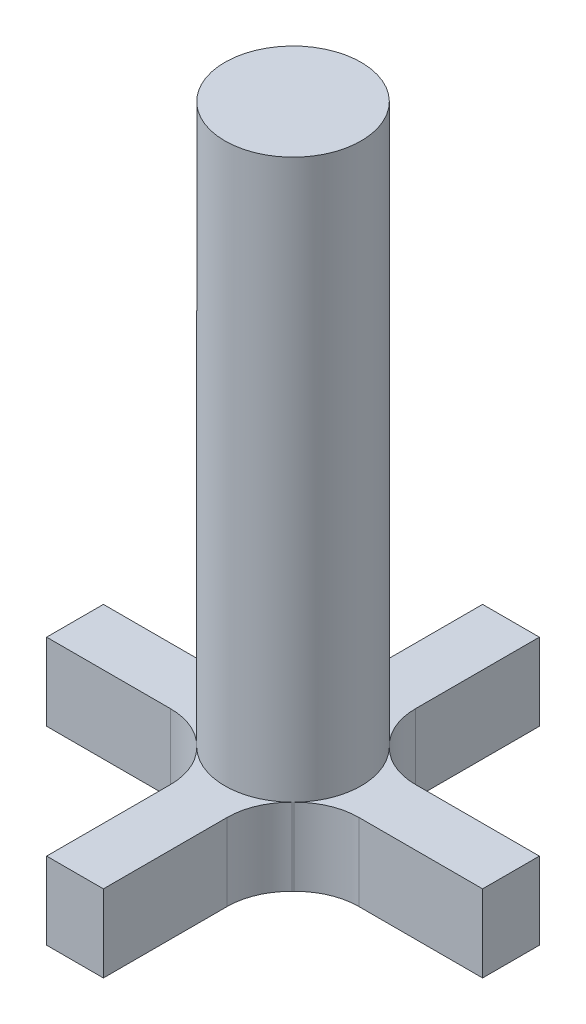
ISO-10303-21;
HEADER;
FILE_DESCRIPTION(('STEP AP214'),'2;1');
FILE_NAME('part.step','',(''),(''),'','','');
FILE_SCHEMA(('AUTOMOTIVE_DESIGN { 1 0 10303 214 1 1 1 1 }'));
ENDSEC;
DATA;
#1=APPLICATION_CONTEXT('core data for automotive mechanical design processes');
#2=APPLICATION_PROTOCOL_DEFINITION('international standard','automotive_design',2000,#1);
#3=PRODUCT_CONTEXT('',#1,'mechanical');
#4=PRODUCT('Part','Part','',(#3));
#5=PRODUCT_RELATED_PRODUCT_CATEGORY('part','',(#4));
#6=PRODUCT_DEFINITION_FORMATION('','',#4);
#7=PRODUCT_DEFINITION_CONTEXT('part definition',#1,'design');
#8=PRODUCT_DEFINITION('design','',#6,#7);
#9=PRODUCT_DEFINITION_SHAPE('','',#8);
#10=(LENGTH_UNIT() NAMED_UNIT(*) SI_UNIT(.MILLI.,.METRE.));
#11=(NAMED_UNIT(*) PLANE_ANGLE_UNIT() SI_UNIT($,.RADIAN.));
#12=(NAMED_UNIT(*) SI_UNIT($,.STERADIAN.) SOLID_ANGLE_UNIT());
#13=UNCERTAINTY_MEASURE_WITH_UNIT(LENGTH_MEASURE(1.E-05),#10,'distance_accuracy_value','');
#14=(GEOMETRIC_REPRESENTATION_CONTEXT(3) GLOBAL_UNCERTAINTY_ASSIGNED_CONTEXT((#13)) GLOBAL_UNIT_ASSIGNED_CONTEXT((#10,
#11,#12)) REPRESENTATION_CONTEXT('',''));
#15=CARTESIAN_POINT('',(0.,0.,0.));
#16=DIRECTION('',(0.,0.,1.));
#17=DIRECTION('',(1.,0.,0.));
#18=AXIS2_PLACEMENT_3D('',#15,#16,#17);
#19=CARTESIAN_POINT('',(0.,35.56,0.));
#20=DIRECTION('',(0.,-1.,0.));
#21=DIRECTION('',(0.,0.,-1.));
#22=AXIS2_PLACEMENT_3D('',#19,#20,#21);
#23=CYLINDRICAL_SURFACE('',#22,3.81);
#24=CARTESIAN_POINT('',(0.,35.56,0.));
#25=DIRECTION('',(0.,1.,0.));
#26=DIRECTION('',(0.,0.,1.));
#27=AXIS2_PLACEMENT_3D('',#24,#25,#26);
#28=CIRCLE('',#27,3.81);
#29=CARTESIAN_POINT('',(0.,35.56,3.81));
#30=VERTEX_POINT('',#29);
#31=EDGE_CURVE('E341',#30,#30,#28,.T.);
#32=ORIENTED_EDGE('',*,*,#31,.F.);
#33=EDGE_LOOP('',(#32));
#34=FACE_BOUND('',#33,.T.);
#35=CARTESIAN_POINT('',(0.,0.,0.));
#36=DIRECTION('',(0.,1.,0.));
#37=DIRECTION('',(0.,0.,1.));
#38=AXIS2_PLACEMENT_3D('',#35,#36,#37);
#39=CIRCLE('',#38,3.81);
#40=CARTESIAN_POINT('',(2.72730759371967,0.,-2.66043103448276));
#41=VERTEX_POINT('',#40);
#42=CARTESIAN_POINT('',(2.66043103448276,0.,-2.72730759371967));
#43=VERTEX_POINT('',#42);
#44=EDGE_CURVE('E347',#41,#43,#39,.T.);
#45=ORIENTED_EDGE('',*,*,#44,.T.);
#46=DIRECTION('',(0.,-1.,0.));
#47=VECTOR('',#46,1.);
#48=CARTESIAN_POINT('',(2.66043103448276,35.56,-2.72730759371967));
#49=LINE('',#48,#47);
#50=CARTESIAN_POINT('',(2.66043103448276,4.318,-2.72730759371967));
#51=VERTEX_POINT('',#50);
#52=EDGE_CURVE('E383',#43,#51,#49,.F.);
#53=ORIENTED_EDGE('',*,*,#52,.T.);
#54=CARTESIAN_POINT('',(0.,4.318,0.));
#55=DIRECTION('',(0.,-1.,0.));
#56=DIRECTION('',(0.,0.,-1.));
#57=AXIS2_PLACEMENT_3D('',#54,#55,#56);
#58=CIRCLE('',#57,3.81);
#59=CARTESIAN_POINT('',(-2.66043103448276,4.318,-2.72730759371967));
#60=VERTEX_POINT('',#59);
#61=EDGE_CURVE('E215',#60,#51,#58,.T.);
#62=ORIENTED_EDGE('',*,*,#61,.F.);
#63=DIRECTION('',(0.,-1.,0.));
#64=VECTOR('',#63,1.);
#65=CARTESIAN_POINT('',(-2.66043103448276,35.56,-2.72730759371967));
#66=LINE('',#65,#64);
#67=CARTESIAN_POINT('',(-2.66043103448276,0.,-2.72730759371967));
#68=VERTEX_POINT('',#67);
#69=EDGE_CURVE('E375',#60,#68,#66,.T.);
#70=ORIENTED_EDGE('',*,*,#69,.T.);
#71=CARTESIAN_POINT('',(-2.72730759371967,0.,-2.66043103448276));
#72=VERTEX_POINT('',#71);
#73=EDGE_CURVE('E351',#68,#72,#39,.T.);
#74=ORIENTED_EDGE('',*,*,#73,.T.);
#75=DIRECTION('',(0.,-1.,0.));
#76=VECTOR('',#75,1.);
#77=CARTESIAN_POINT('',(-2.72730759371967,35.56,-2.66043103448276));
#78=LINE('',#77,#76);
#79=CARTESIAN_POINT('',(-2.72730759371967,4.318,-2.66043103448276));
#80=VERTEX_POINT('',#79);
#81=EDGE_CURVE('E371',#72,#80,#78,.F.);
#82=ORIENTED_EDGE('',*,*,#81,.T.);
#83=CARTESIAN_POINT('',(0.,4.318,0.));
#84=DIRECTION('',(0.,-1.,0.));
#85=DIRECTION('',(0.,0.,-1.));
#86=AXIS2_PLACEMENT_3D('',#83,#84,#85);
#87=CIRCLE('',#86,3.81);
#88=CARTESIAN_POINT('',(-2.72730759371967,4.318,2.66043103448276));
#89=VERTEX_POINT('',#88);
#90=EDGE_CURVE('E254',#89,#80,#87,.T.);
#91=ORIENTED_EDGE('',*,*,#90,.F.);
#92=DIRECTION('',(0.,-1.,0.));
#93=VECTOR('',#92,1.);
#94=CARTESIAN_POINT('',(-2.72730759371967,35.56,2.66043103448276));
#95=LINE('',#94,#93);
#96=CARTESIAN_POINT('',(-2.72730759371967,0.,2.66043103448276));
#97=VERTEX_POINT('',#96);
#98=EDGE_CURVE('E367',#89,#97,#95,.T.);
#99=ORIENTED_EDGE('',*,*,#98,.T.);
#100=CARTESIAN_POINT('',(-2.66043103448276,0.,2.72730759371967));
#101=VERTEX_POINT('',#100);
#102=EDGE_CURVE('E337',#97,#101,#39,.T.);
#103=ORIENTED_EDGE('',*,*,#102,.T.);
#104=DIRECTION('',(0.,-1.,0.));
#105=VECTOR('',#104,1.);
#106=CARTESIAN_POINT('',(-2.66043103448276,35.56,2.72730759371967));
#107=LINE('',#106,#105);
#108=CARTESIAN_POINT('',(-2.66043103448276,4.318,2.72730759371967));
#109=VERTEX_POINT('',#108);
#110=EDGE_CURVE('E363',#101,#109,#107,.F.);
#111=ORIENTED_EDGE('',*,*,#110,.T.);
#112=CARTESIAN_POINT('',(0.,4.318,0.));
#113=DIRECTION('',(0.,-1.,0.));
#114=DIRECTION('',(0.,0.,-1.));
#115=AXIS2_PLACEMENT_3D('',#112,#113,#114);
#116=CIRCLE('',#115,3.81);
#117=CARTESIAN_POINT('',(2.66043103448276,4.318,2.72730759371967));
#118=VERTEX_POINT('',#117);
#119=EDGE_CURVE('E321',#118,#109,#116,.T.);
#120=ORIENTED_EDGE('',*,*,#119,.F.);
#121=DIRECTION('',(0.,-1.,0.));
#122=VECTOR('',#121,1.);
#123=CARTESIAN_POINT('',(2.66043103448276,35.56,2.72730759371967));
#124=LINE('',#123,#122);
#125=CARTESIAN_POINT('',(2.66043103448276,0.,2.72730759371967));
#126=VERTEX_POINT('',#125);
#127=EDGE_CURVE('E359',#118,#126,#124,.T.);
#128=ORIENTED_EDGE('',*,*,#127,.T.);
#129=CARTESIAN_POINT('',(2.72730759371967,0.,2.66043103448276));
#130=VERTEX_POINT('',#129);
#131=EDGE_CURVE('E346',#126,#130,#39,.T.);
#132=ORIENTED_EDGE('',*,*,#131,.T.);
#133=DIRECTION('',(0.,-1.,0.));
#134=VECTOR('',#133,1.);
#135=CARTESIAN_POINT('',(2.72730759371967,35.56,2.66043103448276));
#136=LINE('',#135,#134);
#137=CARTESIAN_POINT('',(2.72730759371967,4.318,2.66043103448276));
#138=VERTEX_POINT('',#137);
#139=EDGE_CURVE('E355',#130,#138,#136,.F.);
#140=ORIENTED_EDGE('',*,*,#139,.T.);
#141=CARTESIAN_POINT('',(0.,4.318,0.));
#142=DIRECTION('',(0.,-1.,0.));
#143=DIRECTION('',(0.,0.,-1.));
#144=AXIS2_PLACEMENT_3D('',#141,#142,#143);
#145=CIRCLE('',#144,3.81);
#146=CARTESIAN_POINT('',(2.72730759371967,4.318,-2.66043103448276));
#147=VERTEX_POINT('',#146);
#148=EDGE_CURVE('E286',#147,#138,#145,.T.);
#149=ORIENTED_EDGE('',*,*,#148,.F.);
#150=DIRECTION('',(0.,-1.,0.));
#151=VECTOR('',#150,1.);
#152=CARTESIAN_POINT('',(2.72730759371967,35.56,-2.66043103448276));
#153=LINE('',#152,#151);
#154=EDGE_CURVE('E379',#147,#41,#153,.T.);
#155=ORIENTED_EDGE('',*,*,#154,.T.);
#156=EDGE_LOOP('',(#45,#53,#62,#70,#74,#82,#91,#99,#103,#111,#120,#128,#132,#140,#149,#155));
#157=FACE_BOUND('',#156,.T.);
#158=ADVANCED_FACE('F41',(#34,#157),#23,.T.);
#159=CARTESIAN_POINT('',(0.,35.56,0.));
#160=DIRECTION('',(0.,1.,0.));
#161=DIRECTION('',(0.,0.,1.));
#162=AXIS2_PLACEMENT_3D('',#159,#160,#161);
#163=PLANE('',#162);
#164=ORIENTED_EDGE('',*,*,#31,.T.);
#165=EDGE_LOOP('',(#164));
#166=FACE_BOUND('',#165,.T.);
#167=ADVANCED_FACE('F533',(#166),#163,.T.);
#168=CARTESIAN_POINT('',(0.,0.,0.));
#169=DIRECTION('',(0.,1.,0.));
#170=DIRECTION('',(0.,0.,1.));
#171=AXIS2_PLACEMENT_3D('',#168,#169,#170);
#172=PLANE('',#171);
#173=ORIENTED_EDGE('',*,*,#131,.F.);
#174=CARTESIAN_POINT('',(5.1435,0.,5.27279468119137));
#175=DIRECTION('',(0.,1.,0.));
#176=DIRECTION('',(0.,0.,1.));
#177=AXIS2_PLACEMENT_3D('',#174,#175,#176);
#178=CIRCLE('',#177,3.556);
#179=CARTESIAN_POINT('',(1.5875,0.,5.27279468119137));
#180=VERTEX_POINT('',#179);
#181=EDGE_CURVE('E447',#126,#180,#178,.T.);
#182=ORIENTED_EDGE('',*,*,#181,.T.);
#183=DIRECTION('',(0.,0.,-1.));
#184=VECTOR('',#183,1.);
#185=CARTESIAN_POINT('',(1.5875,0.,0.));
#186=LINE('',#185,#184);
#187=CARTESIAN_POINT('',(1.5875,0.,12.192));
#188=VERTEX_POINT('',#187);
#189=EDGE_CURVE('E305',#188,#180,#186,.T.);
#190=ORIENTED_EDGE('',*,*,#189,.F.);
#191=DIRECTION('',(1.,0.,0.));
#192=VECTOR('',#191,1.);
#193=CARTESIAN_POINT('',(0.,0.,12.192));
#194=LINE('',#193,#192);
#195=CARTESIAN_POINT('',(-1.5875,0.,12.192));
#196=VERTEX_POINT('',#195);
#197=EDGE_CURVE('E328',#196,#188,#194,.T.);
#198=ORIENTED_EDGE('',*,*,#197,.F.);
#199=DIRECTION('',(0.,0.,-1.));
#200=VECTOR('',#199,1.);
#201=CARTESIAN_POINT('',(-1.5875,0.,0.));
#202=LINE('',#201,#200);
#203=CARTESIAN_POINT('',(-1.5875,0.,5.27279468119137));
#204=VERTEX_POINT('',#203);
#205=EDGE_CURVE('E314',#196,#204,#202,.T.);
#206=ORIENTED_EDGE('',*,*,#205,.T.);
#207=CARTESIAN_POINT('',(-5.1435,0.,5.27279468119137));
#208=DIRECTION('',(0.,1.,0.));
#209=DIRECTION('',(0.,0.,1.));
#210=AXIS2_PLACEMENT_3D('',#207,#208,#209);
#211=CIRCLE('',#210,3.556);
#212=EDGE_CURVE('E441',#204,#101,#211,.T.);
#213=ORIENTED_EDGE('',*,*,#212,.T.);
#214=ORIENTED_EDGE('',*,*,#102,.F.);
#215=CARTESIAN_POINT('',(-5.27279468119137,0.,5.1435));
#216=DIRECTION('',(0.,1.,0.));
#217=DIRECTION('',(0.,0.,1.));
#218=AXIS2_PLACEMENT_3D('',#215,#216,#217);
#219=CIRCLE('',#218,3.556);
#220=CARTESIAN_POINT('',(-5.27279468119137,0.,1.5875));
#221=VERTEX_POINT('',#220);
#222=EDGE_CURVE('E434',#97,#221,#219,.T.);
#223=ORIENTED_EDGE('',*,*,#222,.T.);
#224=DIRECTION('',(1.,0.,0.));
#225=VECTOR('',#224,1.);
#226=CARTESIAN_POINT('',(0.,0.,1.5875));
#227=LINE('',#226,#225);
#228=CARTESIAN_POINT('',(-12.192,0.,1.5875));
#229=VERTEX_POINT('',#228);
#230=EDGE_CURVE('E250',#229,#221,#227,.T.);
#231=ORIENTED_EDGE('',*,*,#230,.F.);
#232=DIRECTION('',(0.,0.,-1.));
#233=VECTOR('',#232,1.);
#234=CARTESIAN_POINT('',(-12.192,0.,0.));
#235=LINE('',#234,#233);
#236=CARTESIAN_POINT('',(-12.192,0.,-1.5875));
#237=VERTEX_POINT('',#236);
#238=EDGE_CURVE('E243',#229,#237,#235,.T.);
#239=ORIENTED_EDGE('',*,*,#238,.T.);
#240=DIRECTION('',(1.,0.,0.));
#241=VECTOR('',#240,1.);
#242=CARTESIAN_POINT('',(0.,0.,-1.5875));
#243=LINE('',#242,#241);
#244=CARTESIAN_POINT('',(-5.27279468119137,0.,-1.5875));
#245=VERTEX_POINT('',#244);
#246=EDGE_CURVE('E265',#237,#245,#243,.T.);
#247=ORIENTED_EDGE('',*,*,#246,.T.);
#248=CARTESIAN_POINT('',(-5.27279468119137,0.,-5.1435));
#249=DIRECTION('',(0.,1.,0.));
#250=DIRECTION('',(0.,0.,1.));
#251=AXIS2_PLACEMENT_3D('',#248,#249,#250);
#252=CIRCLE('',#251,3.556);
#253=EDGE_CURVE('E428',#245,#72,#252,.T.);
#254=ORIENTED_EDGE('',*,*,#253,.T.);
#255=ORIENTED_EDGE('',*,*,#73,.F.);
#256=CARTESIAN_POINT('',(-5.1435,0.,-5.27279468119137));
#257=DIRECTION('',(0.,1.,0.));
#258=DIRECTION('',(0.,0.,1.));
#259=AXIS2_PLACEMENT_3D('',#256,#257,#258);
#260=CIRCLE('',#259,3.556);
#261=CARTESIAN_POINT('',(-1.5875,0.,-5.27279468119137));
#262=VERTEX_POINT('',#261);
#263=EDGE_CURVE('E422',#68,#262,#260,.T.);
#264=ORIENTED_EDGE('',*,*,#263,.T.);
#265=DIRECTION('',(0.,0.,-1.));
#266=VECTOR('',#265,1.);
#267=CARTESIAN_POINT('',(-1.5875,0.,0.));
#268=LINE('',#267,#266);
#269=CARTESIAN_POINT('',(-1.5875,0.,-12.192));
#270=VERTEX_POINT('',#269);
#271=EDGE_CURVE('E237',#262,#270,#268,.T.);
#272=ORIENTED_EDGE('',*,*,#271,.T.);
#273=DIRECTION('',(1.,0.,0.));
#274=VECTOR('',#273,1.);
#275=CARTESIAN_POINT('',(0.,0.,-12.192));
#276=LINE('',#275,#274);
#277=CARTESIAN_POINT('',(1.5875,0.,-12.192));
#278=VERTEX_POINT('',#277);
#279=EDGE_CURVE('E222',#270,#278,#276,.T.);
#280=ORIENTED_EDGE('',*,*,#279,.T.);
#281=DIRECTION('',(0.,0.,-1.));
#282=VECTOR('',#281,1.);
#283=CARTESIAN_POINT('',(1.5875,0.,0.));
#284=LINE('',#283,#282);
#285=CARTESIAN_POINT('',(1.5875,0.,-5.27279468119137));
#286=VERTEX_POINT('',#285);
#287=EDGE_CURVE('E234',#286,#278,#284,.T.);
#288=ORIENTED_EDGE('',*,*,#287,.F.);
#289=CARTESIAN_POINT('',(5.1435,0.,-5.27279468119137));
#290=DIRECTION('',(0.,1.,0.));
#291=DIRECTION('',(0.,0.,1.));
#292=AXIS2_PLACEMENT_3D('',#289,#290,#291);
#293=CIRCLE('',#292,3.556);
#294=EDGE_CURVE('E409',#286,#43,#293,.T.);
#295=ORIENTED_EDGE('',*,*,#294,.T.);
#296=ORIENTED_EDGE('',*,*,#44,.F.);
#297=CARTESIAN_POINT('',(5.27279468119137,0.,-5.1435));
#298=DIRECTION('',(0.,1.,0.));
#299=DIRECTION('',(0.,0.,1.));
#300=AXIS2_PLACEMENT_3D('',#297,#298,#299);
#301=CIRCLE('',#300,3.556);
#302=CARTESIAN_POINT('',(5.27279468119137,0.,-1.5875));
#303=VERTEX_POINT('',#302);
#304=EDGE_CURVE('E415',#41,#303,#301,.T.);
#305=ORIENTED_EDGE('',*,*,#304,.T.);
#306=DIRECTION('',(1.,0.,0.));
#307=VECTOR('',#306,1.);
#308=CARTESIAN_POINT('',(0.,0.,-1.5875));
#309=LINE('',#308,#307);
#310=CARTESIAN_POINT('',(12.192,0.,-1.5875));
#311=VERTEX_POINT('',#310);
#312=EDGE_CURVE('E283',#303,#311,#309,.T.);
#313=ORIENTED_EDGE('',*,*,#312,.T.);
#314=DIRECTION('',(0.,0.,-1.));
#315=VECTOR('',#314,1.);
#316=CARTESIAN_POINT('',(12.192,0.,0.));
#317=LINE('',#316,#315);
#318=CARTESIAN_POINT('',(12.192,0.,1.5875));
#319=VERTEX_POINT('',#318);
#320=EDGE_CURVE('E275',#319,#311,#317,.T.);
#321=ORIENTED_EDGE('',*,*,#320,.F.);
#322=DIRECTION('',(1.,0.,0.));
#323=VECTOR('',#322,1.);
#324=CARTESIAN_POINT('',(0.,0.,1.5875));
#325=LINE('',#324,#323);
#326=CARTESIAN_POINT('',(5.27279468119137,0.,1.5875));
#327=VERTEX_POINT('',#326);
#328=EDGE_CURVE('E296',#327,#319,#325,.T.);
#329=ORIENTED_EDGE('',*,*,#328,.F.);
#330=CARTESIAN_POINT('',(5.27279468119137,0.,5.1435));
#331=DIRECTION('',(0.,1.,0.));
#332=DIRECTION('',(0.,0.,1.));
#333=AXIS2_PLACEMENT_3D('',#330,#331,#332);
#334=CIRCLE('',#333,3.556);
#335=EDGE_CURVE('E50',#327,#130,#334,.T.);
#336=ORIENTED_EDGE('',*,*,#335,.T.);
#337=EDGE_LOOP('',(#173,#182,#190,#198,#206,#213,#214,#223,#231,#239,#247,#254,#255,#264,#272,
#280,#288,#295,#296,#305,#313,#321,#329,#336));
#338=FACE_BOUND('',#337,.T.);
#339=ADVANCED_FACE('F458',(#338),#172,.F.);
#340=CARTESIAN_POINT('',(1.5875,4.318,0.));
#341=DIRECTION('',(-1.,0.,0.));
#342=DIRECTION('',(0.,0.,1.));
#343=AXIS2_PLACEMENT_3D('',#340,#341,#342);
#344=PLANE('',#343);
#345=ORIENTED_EDGE('',*,*,#189,.T.);
#346=DIRECTION('',(0.,1.,0.));
#347=VECTOR('',#346,1.);
#348=CARTESIAN_POINT('',(1.5875,4.318,5.27279468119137));
#349=LINE('',#348,#347);
#350=CARTESIAN_POINT('',(1.5875,4.318,5.27279468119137));
#351=VERTEX_POINT('',#350);
#352=EDGE_CURVE('E403',#180,#351,#349,.T.);
#353=ORIENTED_EDGE('',*,*,#352,.T.);
#354=DIRECTION('',(0.,0.,-1.));
#355=VECTOR('',#354,1.);
#356=CARTESIAN_POINT('',(1.5875,4.318,0.));
#357=LINE('',#356,#355);
#358=CARTESIAN_POINT('',(1.5875,4.318,12.192));
#359=VERTEX_POINT('',#358);
#360=EDGE_CURVE('E309',#359,#351,#357,.T.);
#361=ORIENTED_EDGE('',*,*,#360,.F.);
#362=DIRECTION('',(0.,-1.,0.));
#363=VECTOR('',#362,1.);
#364=CARTESIAN_POINT('',(1.5875,4.318,12.192));
#365=LINE('',#364,#363);
#366=EDGE_CURVE('E324',#359,#188,#365,.T.);
#367=ORIENTED_EDGE('',*,*,#366,.T.);
#368=EDGE_LOOP('',(#345,#353,#361,#367));
#369=FACE_BOUND('',#368,.T.);
#370=ADVANCED_FACE('F525',(#369),#344,.F.);
#371=CARTESIAN_POINT('',(-1.5875,4.318,0.));
#372=DIRECTION('',(-1.,0.,0.));
#373=DIRECTION('',(0.,0.,1.));
#374=AXIS2_PLACEMENT_3D('',#371,#372,#373);
#375=PLANE('',#374);
#376=DIRECTION('',(0.,0.,-1.));
#377=VECTOR('',#376,1.);
#378=CARTESIAN_POINT('',(-1.5875,4.318,0.));
#379=LINE('',#378,#377);
#380=CARTESIAN_POINT('',(-1.5875,4.318,12.192));
#381=VERTEX_POINT('',#380);
#382=CARTESIAN_POINT('',(-1.5875,4.318,5.27279468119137));
#383=VERTEX_POINT('',#382);
#384=EDGE_CURVE('E317',#381,#383,#379,.T.);
#385=ORIENTED_EDGE('',*,*,#384,.T.);
#386=DIRECTION('',(0.,-1.,0.));
#387=VECTOR('',#386,1.);
#388=CARTESIAN_POINT('',(-1.5875,4.318,5.27279468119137));
#389=LINE('',#388,#387);
#390=EDGE_CURVE('E399',#383,#204,#389,.T.);
#391=ORIENTED_EDGE('',*,*,#390,.T.);
#392=ORIENTED_EDGE('',*,*,#205,.F.);
#393=DIRECTION('',(0.,-1.,0.));
#394=VECTOR('',#393,1.);
#395=CARTESIAN_POINT('',(-1.5875,4.318,12.192));
#396=LINE('',#395,#394);
#397=EDGE_CURVE('E334',#381,#196,#396,.T.);
#398=ORIENTED_EDGE('',*,*,#397,.F.);
#399=EDGE_LOOP('',(#385,#391,#392,#398));
#400=FACE_BOUND('',#399,.T.);
#401=ADVANCED_FACE('F511',(#400),#375,.T.);
#402=CARTESIAN_POINT('',(0.,4.318,12.192));
#403=DIRECTION('',(0.,0.,-1.));
#404=DIRECTION('',(-1.,0.,0.));
#405=AXIS2_PLACEMENT_3D('',#402,#403,#404);
#406=PLANE('',#405);
#407=ORIENTED_EDGE('',*,*,#197,.T.);
#408=ORIENTED_EDGE('',*,*,#366,.F.);
#409=DIRECTION('',(1.,0.,0.));
#410=VECTOR('',#409,1.);
#411=CARTESIAN_POINT('',(0.,4.318,12.192));
#412=LINE('',#411,#410);
#413=EDGE_CURVE('E313',#381,#359,#412,.T.);
#414=ORIENTED_EDGE('',*,*,#413,.F.);
#415=ORIENTED_EDGE('',*,*,#397,.T.);
#416=EDGE_LOOP('',(#407,#408,#414,#415));
#417=FACE_BOUND('',#416,.T.);
#418=ADVANCED_FACE('F517',(#417),#406,.F.);
#419=CARTESIAN_POINT('',(0.,4.318,0.));
#420=DIRECTION('',(0.,-1.,0.));
#421=DIRECTION('',(0.,0.,-1.));
#422=AXIS2_PLACEMENT_3D('',#419,#420,#421);
#423=PLANE('',#422);
#424=ORIENTED_EDGE('',*,*,#360,.T.);
#425=CARTESIAN_POINT('',(5.1435,4.318,5.27279468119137));
#426=DIRECTION('',(0.,-1.,0.));
#427=DIRECTION('',(0.,0.,-1.));
#428=AXIS2_PLACEMENT_3D('',#425,#426,#427);
#429=CIRCLE('',#428,3.556);
#430=EDGE_CURVE('E450',#351,#118,#429,.T.);
#431=ORIENTED_EDGE('',*,*,#430,.T.);
#432=ORIENTED_EDGE('',*,*,#119,.T.);
#433=CARTESIAN_POINT('',(-5.1435,4.318,5.27279468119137));
#434=DIRECTION('',(0.,-1.,0.));
#435=DIRECTION('',(0.,0.,-1.));
#436=AXIS2_PLACEMENT_3D('',#433,#434,#435);
#437=CIRCLE('',#436,3.556);
#438=EDGE_CURVE('E444',#109,#383,#437,.T.);
#439=ORIENTED_EDGE('',*,*,#438,.T.);
#440=ORIENTED_EDGE('',*,*,#384,.F.);
#441=ORIENTED_EDGE('',*,*,#413,.T.);
#442=EDGE_LOOP('',(#424,#431,#432,#439,#440,#441));
#443=FACE_BOUND('',#442,.T.);
#444=ADVANCED_FACE('F509',(#443),#423,.F.);
#445=CARTESIAN_POINT('',(12.192,4.318,0.));
#446=DIRECTION('',(-1.,0.,0.));
#447=DIRECTION('',(0.,0.,1.));
#448=AXIS2_PLACEMENT_3D('',#445,#446,#447);
#449=PLANE('',#448);
#450=ORIENTED_EDGE('',*,*,#320,.T.);
#451=DIRECTION('',(0.,-1.,0.));
#452=VECTOR('',#451,1.);
#453=CARTESIAN_POINT('',(12.192,4.318,-1.5875));
#454=LINE('',#453,#452);
#455=CARTESIAN_POINT('',(12.192,4.318,-1.5875));
#456=VERTEX_POINT('',#455);
#457=EDGE_CURVE('E301',#456,#311,#454,.T.);
#458=ORIENTED_EDGE('',*,*,#457,.F.);
#459=DIRECTION('',(0.,0.,-1.));
#460=VECTOR('',#459,1.);
#461=CARTESIAN_POINT('',(12.192,4.318,0.));
#462=LINE('',#461,#460);
#463=CARTESIAN_POINT('',(12.192,4.318,1.5875));
#464=VERTEX_POINT('',#463);
#465=EDGE_CURVE('E278',#464,#456,#462,.T.);
#466=ORIENTED_EDGE('',*,*,#465,.F.);
#467=DIRECTION('',(0.,-1.,0.));
#468=VECTOR('',#467,1.);
#469=CARTESIAN_POINT('',(12.192,4.318,1.5875));
#470=LINE('',#469,#468);
#471=EDGE_CURVE('E292',#464,#319,#470,.T.);
#472=ORIENTED_EDGE('',*,*,#471,.T.);
#473=EDGE_LOOP('',(#450,#458,#466,#472));
#474=FACE_BOUND('',#473,.T.);
#475=ADVANCED_FACE('F472',(#474),#449,.F.);
#476=CARTESIAN_POINT('',(0.,4.318,-1.5875));
#477=DIRECTION('',(0.,0.,-1.));
#478=DIRECTION('',(-1.,0.,0.));
#479=AXIS2_PLACEMENT_3D('',#476,#477,#478);
#480=PLANE('',#479);
#481=ORIENTED_EDGE('',*,*,#312,.F.);
#482=DIRECTION('',(0.,-1.,0.));
#483=VECTOR('',#482,1.);
#484=CARTESIAN_POINT('',(5.27279468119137,4.318,-1.5875));
#485=LINE('',#484,#483);
#486=CARTESIAN_POINT('',(5.27279468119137,4.318,-1.5875));
#487=VERTEX_POINT('',#486);
#488=EDGE_CURVE('E387',#303,#487,#485,.F.);
#489=ORIENTED_EDGE('',*,*,#488,.T.);
#490=DIRECTION('',(1.,0.,0.));
#491=VECTOR('',#490,1.);
#492=CARTESIAN_POINT('',(0.,4.318,-1.5875));
#493=LINE('',#492,#491);
#494=EDGE_CURVE('E289',#487,#456,#493,.T.);
#495=ORIENTED_EDGE('',*,*,#494,.T.);
#496=ORIENTED_EDGE('',*,*,#457,.T.);
#497=EDGE_LOOP('',(#481,#489,#495,#496));
#498=FACE_BOUND('',#497,.T.);
#499=ADVANCED_FACE('F475',(#498),#480,.T.);
#500=CARTESIAN_POINT('',(0.,4.318,1.5875));
#501=DIRECTION('',(0.,0.,-1.));
#502=DIRECTION('',(-1.,0.,0.));
#503=AXIS2_PLACEMENT_3D('',#500,#501,#502);
#504=PLANE('',#503);
#505=DIRECTION('',(1.,0.,0.));
#506=VECTOR('',#505,1.);
#507=CARTESIAN_POINT('',(0.,4.318,1.5875));
#508=LINE('',#507,#506);
#509=CARTESIAN_POINT('',(5.27279468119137,4.318,1.5875));
#510=VERTEX_POINT('',#509);
#511=EDGE_CURVE('E282',#510,#464,#508,.T.);
#512=ORIENTED_EDGE('',*,*,#511,.F.);
#513=DIRECTION('',(0.,1.,0.));
#514=VECTOR('',#513,1.);
#515=CARTESIAN_POINT('',(5.27279468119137,0.,1.5875));
#516=LINE('',#515,#514);
#517=EDGE_CURVE('E406',#510,#327,#516,.F.);
#518=ORIENTED_EDGE('',*,*,#517,.T.);
#519=ORIENTED_EDGE('',*,*,#328,.T.);
#520=ORIENTED_EDGE('',*,*,#471,.F.);
#521=EDGE_LOOP('',(#512,#518,#519,#520));
#522=FACE_BOUND('',#521,.T.);
#523=ADVANCED_FACE('F464',(#522),#504,.F.);
#524=CARTESIAN_POINT('',(0.,4.318,0.));
#525=DIRECTION('',(0.,-1.,0.));
#526=DIRECTION('',(0.,0.,-1.));
#527=AXIS2_PLACEMENT_3D('',#524,#525,#526);
#528=PLANE('',#527);
#529=ORIENTED_EDGE('',*,*,#465,.T.);
#530=ORIENTED_EDGE('',*,*,#494,.F.);
#531=CARTESIAN_POINT('',(5.27279468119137,4.318,-5.1435));
#532=DIRECTION('',(0.,-1.,0.));
#533=DIRECTION('',(0.,0.,-1.));
#534=AXIS2_PLACEMENT_3D('',#531,#532,#533);
#535=CIRCLE('',#534,3.556);
#536=EDGE_CURVE('E418',#487,#147,#535,.T.);
#537=ORIENTED_EDGE('',*,*,#536,.T.);
#538=ORIENTED_EDGE('',*,*,#148,.T.);
#539=CARTESIAN_POINT('',(5.27279468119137,4.318,5.1435));
#540=DIRECTION('',(0.,-1.,0.));
#541=DIRECTION('',(0.,0.,-1.));
#542=AXIS2_PLACEMENT_3D('',#539,#540,#541);
#543=CIRCLE('',#542,3.556);
#544=EDGE_CURVE('E11',#138,#510,#543,.T.);
#545=ORIENTED_EDGE('',*,*,#544,.T.);
#546=ORIENTED_EDGE('',*,*,#511,.T.);
#547=EDGE_LOOP('',(#529,#530,#537,#538,#545,#546));
#548=FACE_BOUND('',#547,.T.);
#549=ADVANCED_FACE('F467',(#548),#528,.F.);
#550=CARTESIAN_POINT('',(-12.192,4.318,0.));
#551=DIRECTION('',(-1.,0.,0.));
#552=DIRECTION('',(0.,0.,1.));
#553=AXIS2_PLACEMENT_3D('',#550,#551,#552);
#554=PLANE('',#553);
#555=ORIENTED_EDGE('',*,*,#238,.F.);
#556=DIRECTION('',(0.,-1.,0.));
#557=VECTOR('',#556,1.);
#558=CARTESIAN_POINT('',(-12.192,4.318,1.5875));
#559=LINE('',#558,#557);
#560=CARTESIAN_POINT('',(-12.192,4.318,1.5875));
#561=VERTEX_POINT('',#560);
#562=EDGE_CURVE('E272',#561,#229,#559,.T.);
#563=ORIENTED_EDGE('',*,*,#562,.F.);
#564=DIRECTION('',(0.,0.,-1.));
#565=VECTOR('',#564,1.);
#566=CARTESIAN_POINT('',(-12.192,4.318,0.));
#567=LINE('',#566,#565);
#568=CARTESIAN_POINT('',(-12.192,4.318,-1.5875));
#569=VERTEX_POINT('',#568);
#570=EDGE_CURVE('E245',#561,#569,#567,.T.);
#571=ORIENTED_EDGE('',*,*,#570,.T.);
#572=DIRECTION('',(0.,-1.,0.));
#573=VECTOR('',#572,1.);
#574=CARTESIAN_POINT('',(-12.192,4.318,-1.5875));
#575=LINE('',#574,#573);
#576=EDGE_CURVE('E261',#569,#237,#575,.T.);
#577=ORIENTED_EDGE('',*,*,#576,.T.);
#578=EDGE_LOOP('',(#555,#563,#571,#577));
#579=FACE_BOUND('',#578,.T.);
#580=ADVANCED_FACE('F664',(#579),#554,.T.);
#581=CARTESIAN_POINT('',(0.,4.318,1.5875));
#582=DIRECTION('',(0.,0.,-1.));
#583=DIRECTION('',(-1.,0.,0.));
#584=AXIS2_PLACEMENT_3D('',#581,#582,#583);
#585=PLANE('',#584);
#586=ORIENTED_EDGE('',*,*,#230,.T.);
#587=DIRECTION('',(0.,1.,0.));
#588=VECTOR('',#587,1.);
#589=CARTESIAN_POINT('',(-5.27279468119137,4.318,1.5875));
#590=LINE('',#589,#588);
#591=CARTESIAN_POINT('',(-5.27279468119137,4.318,1.5875));
#592=VERTEX_POINT('',#591);
#593=EDGE_CURVE('E396',#221,#592,#590,.T.);
#594=ORIENTED_EDGE('',*,*,#593,.T.);
#595=DIRECTION('',(1.,0.,0.));
#596=VECTOR('',#595,1.);
#597=CARTESIAN_POINT('',(0.,4.318,1.5875));
#598=LINE('',#597,#596);
#599=EDGE_CURVE('E257',#561,#592,#598,.T.);
#600=ORIENTED_EDGE('',*,*,#599,.F.);
#601=ORIENTED_EDGE('',*,*,#562,.T.);
#602=EDGE_LOOP('',(#586,#594,#600,#601));
#603=FACE_BOUND('',#602,.T.);
#604=ADVANCED_FACE('F654',(#603),#585,.F.);
#605=CARTESIAN_POINT('',(0.,4.318,-1.5875));
#606=DIRECTION('',(0.,0.,-1.));
#607=DIRECTION('',(-1.,0.,0.));
#608=AXIS2_PLACEMENT_3D('',#605,#606,#607);
#609=PLANE('',#608);
#610=DIRECTION('',(1.,0.,0.));
#611=VECTOR('',#610,1.);
#612=CARTESIAN_POINT('',(0.,4.318,-1.5875));
#613=LINE('',#612,#611);
#614=CARTESIAN_POINT('',(-5.27279468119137,4.318,-1.5875));
#615=VERTEX_POINT('',#614);
#616=EDGE_CURVE('E249',#569,#615,#613,.T.);
#617=ORIENTED_EDGE('',*,*,#616,.T.);
#618=DIRECTION('',(0.,-1.,0.));
#619=VECTOR('',#618,1.);
#620=CARTESIAN_POINT('',(-5.27279468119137,4.318,-1.5875));
#621=LINE('',#620,#619);
#622=EDGE_CURVE('E392',#615,#245,#621,.T.);
#623=ORIENTED_EDGE('',*,*,#622,.T.);
#624=ORIENTED_EDGE('',*,*,#246,.F.);
#625=ORIENTED_EDGE('',*,*,#576,.F.);
#626=EDGE_LOOP('',(#617,#623,#624,#625));
#627=FACE_BOUND('',#626,.T.);
#628=ADVANCED_FACE('F644',(#627),#609,.T.);
#629=CARTESIAN_POINT('',(0.,4.318,0.));
#630=DIRECTION('',(0.,-1.,0.));
#631=DIRECTION('',(0.,0.,-1.));
#632=AXIS2_PLACEMENT_3D('',#629,#630,#631);
#633=PLANE('',#632);
#634=ORIENTED_EDGE('',*,*,#570,.F.);
#635=ORIENTED_EDGE('',*,*,#599,.T.);
#636=CARTESIAN_POINT('',(-5.27279468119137,4.318,5.1435));
#637=DIRECTION('',(0.,-1.,0.));
#638=DIRECTION('',(0.,0.,-1.));
#639=AXIS2_PLACEMENT_3D('',#636,#637,#638);
#640=CIRCLE('',#639,3.556);
#641=EDGE_CURVE('E437',#592,#89,#640,.T.);
#642=ORIENTED_EDGE('',*,*,#641,.T.);
#643=ORIENTED_EDGE('',*,*,#90,.T.);
#644=CARTESIAN_POINT('',(-5.27279468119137,4.318,-5.1435));
#645=DIRECTION('',(0.,-1.,0.));
#646=DIRECTION('',(0.,0.,-1.));
#647=AXIS2_PLACEMENT_3D('',#644,#645,#646);
#648=CIRCLE('',#647,3.556);
#649=EDGE_CURVE('E431',#80,#615,#648,.T.);
#650=ORIENTED_EDGE('',*,*,#649,.T.);
#651=ORIENTED_EDGE('',*,*,#616,.F.);
#652=EDGE_LOOP('',(#634,#635,#642,#643,#650,#651));
#653=FACE_BOUND('',#652,.T.);
#654=ADVANCED_FACE('F635',(#653),#633,.F.);
#655=CARTESIAN_POINT('',(1.5875,4.318,0.));
#656=DIRECTION('',(-1.,0.,0.));
#657=DIRECTION('',(0.,0.,1.));
#658=AXIS2_PLACEMENT_3D('',#655,#656,#657);
#659=PLANE('',#658);
#660=DIRECTION('',(0.,0.,-1.));
#661=VECTOR('',#660,1.);
#662=CARTESIAN_POINT('',(1.5875,4.318,0.));
#663=LINE('',#662,#661);
#664=CARTESIAN_POINT('',(1.5875,4.318,-5.27279468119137));
#665=VERTEX_POINT('',#664);
#666=CARTESIAN_POINT('',(1.5875,4.318,-12.192));
#667=VERTEX_POINT('',#666);
#668=EDGE_CURVE('E228',#665,#667,#663,.T.);
#669=ORIENTED_EDGE('',*,*,#668,.F.);
#670=DIRECTION('',(0.,1.,0.));
#671=VECTOR('',#670,1.);
#672=CARTESIAN_POINT('',(1.5875,0.,-5.27279468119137));
#673=LINE('',#672,#671);
#674=EDGE_CURVE('E345',#665,#286,#673,.F.);
#675=ORIENTED_EDGE('',*,*,#674,.T.);
#676=ORIENTED_EDGE('',*,*,#287,.T.);
#677=DIRECTION('',(0.,-1.,0.));
#678=VECTOR('',#677,1.);
#679=CARTESIAN_POINT('',(1.5875,4.318,-12.192));
#680=LINE('',#679,#678);
#681=EDGE_CURVE('E224',#667,#278,#680,.T.);
#682=ORIENTED_EDGE('',*,*,#681,.F.);
#683=EDGE_LOOP('',(#669,#675,#676,#682));
#684=FACE_BOUND('',#683,.T.);
#685=ADVANCED_FACE('F488',(#684),#659,.F.);
#686=CARTESIAN_POINT('',(0.,4.318,-12.192));
#687=DIRECTION('',(0.,0.,-1.));
#688=DIRECTION('',(-1.,0.,0.));
#689=AXIS2_PLACEMENT_3D('',#686,#687,#688);
#690=PLANE('',#689);
#691=ORIENTED_EDGE('',*,*,#279,.F.);
#692=DIRECTION('',(0.,-1.,0.));
#693=VECTOR('',#692,1.);
#694=CARTESIAN_POINT('',(-1.5875,4.318,-12.192));
#695=LINE('',#694,#693);
#696=CARTESIAN_POINT('',(-1.5875,4.318,-12.192));
#697=VERTEX_POINT('',#696);
#698=EDGE_CURVE('E205',#697,#270,#695,.T.);
#699=ORIENTED_EDGE('',*,*,#698,.F.);
#700=DIRECTION('',(1.,0.,0.));
#701=VECTOR('',#700,1.);
#702=CARTESIAN_POINT('',(0.,4.318,-12.192));
#703=LINE('',#702,#701);
#704=EDGE_CURVE('E214',#697,#667,#703,.T.);
#705=ORIENTED_EDGE('',*,*,#704,.T.);
#706=ORIENTED_EDGE('',*,*,#681,.T.);
#707=EDGE_LOOP('',(#691,#699,#705,#706));
#708=FACE_BOUND('',#707,.T.);
#709=ADVANCED_FACE('F219',(#708),#690,.T.);
#710=CARTESIAN_POINT('',(-1.5875,4.318,0.));
#711=DIRECTION('',(-1.,0.,0.));
#712=DIRECTION('',(0.,0.,1.));
#713=AXIS2_PLACEMENT_3D('',#710,#711,#712);
#714=PLANE('',#713);
#715=ORIENTED_EDGE('',*,*,#271,.F.);
#716=DIRECTION('',(0.,-1.,0.));
#717=VECTOR('',#716,1.);
#718=CARTESIAN_POINT('',(-1.5875,4.318,-5.27279468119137));
#719=LINE('',#718,#717);
#720=CARTESIAN_POINT('',(-1.5875,4.318,-5.27279468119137));
#721=VERTEX_POINT('',#720);
#722=EDGE_CURVE('E208',#262,#721,#719,.F.);
#723=ORIENTED_EDGE('',*,*,#722,.T.);
#724=DIRECTION('',(0.,0.,-1.));
#725=VECTOR('',#724,1.);
#726=CARTESIAN_POINT('',(-1.5875,4.318,0.));
#727=LINE('',#726,#725);
#728=EDGE_CURVE('E201',#721,#697,#727,.T.);
#729=ORIENTED_EDGE('',*,*,#728,.T.);
#730=ORIENTED_EDGE('',*,*,#698,.T.);
#731=EDGE_LOOP('',(#715,#723,#729,#730));
#732=FACE_BOUND('',#731,.T.);
#733=ADVANCED_FACE('F204',(#732),#714,.T.);
#734=CARTESIAN_POINT('',(0.,4.318,0.));
#735=DIRECTION('',(0.,-1.,0.));
#736=DIRECTION('',(0.,0.,-1.));
#737=AXIS2_PLACEMENT_3D('',#734,#735,#736);
#738=PLANE('',#737);
#739=ORIENTED_EDGE('',*,*,#61,.T.);
#740=CARTESIAN_POINT('',(5.1435,4.318,-5.27279468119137));
#741=DIRECTION('',(0.,-1.,0.));
#742=DIRECTION('',(0.,0.,-1.));
#743=AXIS2_PLACEMENT_3D('',#740,#741,#742);
#744=CIRCLE('',#743,3.556);
#745=EDGE_CURVE('E412',#51,#665,#744,.T.);
#746=ORIENTED_EDGE('',*,*,#745,.T.);
#747=ORIENTED_EDGE('',*,*,#668,.T.);
#748=ORIENTED_EDGE('',*,*,#704,.F.);
#749=ORIENTED_EDGE('',*,*,#728,.F.);
#750=CARTESIAN_POINT('',(-5.1435,4.318,-5.27279468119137));
#751=DIRECTION('',(0.,-1.,0.));
#752=DIRECTION('',(0.,0.,-1.));
#753=AXIS2_PLACEMENT_3D('',#750,#751,#752);
#754=CIRCLE('',#753,3.556);
#755=EDGE_CURVE('E425',#721,#60,#754,.T.);
#756=ORIENTED_EDGE('',*,*,#755,.T.);
#757=EDGE_LOOP('',(#739,#746,#747,#748,#749,#756));
#758=FACE_BOUND('',#757,.T.);
#759=ADVANCED_FACE('F226',(#758),#738,.F.);
#760=CARTESIAN_POINT('',(5.1435,35.56,-5.27279468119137));
#761=DIRECTION('',(0.,-1.,0.));
#762=DIRECTION('',(0.,0.,-1.));
#763=AXIS2_PLACEMENT_3D('',#760,#761,#762);
#764=CYLINDRICAL_SURFACE('',#763,3.556);
#765=ORIENTED_EDGE('',*,*,#745,.F.);
#766=ORIENTED_EDGE('',*,*,#52,.F.);
#767=ORIENTED_EDGE('',*,*,#294,.F.);
#768=ORIENTED_EDGE('',*,*,#674,.F.);
#769=EDGE_LOOP('',(#765,#766,#767,#768));
#770=FACE_BOUND('',#769,.T.);
#771=ADVANCED_FACE('F486',(#770),#764,.F.);
#772=CARTESIAN_POINT('',(5.27279468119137,35.56,-5.1435));
#773=DIRECTION('',(0.,-1.,0.));
#774=DIRECTION('',(0.,0.,-1.));
#775=AXIS2_PLACEMENT_3D('',#772,#773,#774);
#776=CYLINDRICAL_SURFACE('',#775,3.556);
#777=ORIENTED_EDGE('',*,*,#536,.F.);
#778=ORIENTED_EDGE('',*,*,#488,.F.);
#779=ORIENTED_EDGE('',*,*,#304,.F.);
#780=ORIENTED_EDGE('',*,*,#154,.F.);
#781=EDGE_LOOP('',(#777,#778,#779,#780));
#782=FACE_BOUND('',#781,.T.);
#783=ADVANCED_FACE('F478',(#782),#776,.F.);
#784=CARTESIAN_POINT('',(-5.1435,35.56,-5.27279468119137));
#785=DIRECTION('',(0.,-1.,0.));
#786=DIRECTION('',(0.,0.,-1.));
#787=AXIS2_PLACEMENT_3D('',#784,#785,#786);
#788=CYLINDRICAL_SURFACE('',#787,3.556);
#789=ORIENTED_EDGE('',*,*,#755,.F.);
#790=ORIENTED_EDGE('',*,*,#722,.F.);
#791=ORIENTED_EDGE('',*,*,#263,.F.);
#792=ORIENTED_EDGE('',*,*,#69,.F.);
#793=EDGE_LOOP('',(#789,#790,#791,#792));
#794=FACE_BOUND('',#793,.T.);
#795=ADVANCED_FACE('F550',(#794),#788,.F.);
#796=CARTESIAN_POINT('',(-5.27279468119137,35.56,-5.1435));
#797=DIRECTION('',(0.,-1.,0.));
#798=DIRECTION('',(0.,0.,-1.));
#799=AXIS2_PLACEMENT_3D('',#796,#797,#798);
#800=CYLINDRICAL_SURFACE('',#799,3.556);
#801=ORIENTED_EDGE('',*,*,#649,.F.);
#802=ORIENTED_EDGE('',*,*,#81,.F.);
#803=ORIENTED_EDGE('',*,*,#253,.F.);
#804=ORIENTED_EDGE('',*,*,#622,.F.);
#805=EDGE_LOOP('',(#801,#802,#803,#804));
#806=FACE_BOUND('',#805,.T.);
#807=ADVANCED_FACE('F553',(#806),#800,.F.);
#808=CARTESIAN_POINT('',(-5.27279468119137,35.56,5.1435));
#809=DIRECTION('',(0.,-1.,0.));
#810=DIRECTION('',(0.,0.,-1.));
#811=AXIS2_PLACEMENT_3D('',#808,#809,#810);
#812=CYLINDRICAL_SURFACE('',#811,3.556);
#813=ORIENTED_EDGE('',*,*,#641,.F.);
#814=ORIENTED_EDGE('',*,*,#593,.F.);
#815=ORIENTED_EDGE('',*,*,#222,.F.);
#816=ORIENTED_EDGE('',*,*,#98,.F.);
#817=EDGE_LOOP('',(#813,#814,#815,#816));
#818=FACE_BOUND('',#817,.T.);
#819=ADVANCED_FACE('F556',(#818),#812,.F.);
#820=CARTESIAN_POINT('',(-5.1435,35.56,5.27279468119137));
#821=DIRECTION('',(0.,-1.,0.));
#822=DIRECTION('',(0.,0.,-1.));
#823=AXIS2_PLACEMENT_3D('',#820,#821,#822);
#824=CYLINDRICAL_SURFACE('',#823,3.556);
#825=ORIENTED_EDGE('',*,*,#438,.F.);
#826=ORIENTED_EDGE('',*,*,#110,.F.);
#827=ORIENTED_EDGE('',*,*,#212,.F.);
#828=ORIENTED_EDGE('',*,*,#390,.F.);
#829=EDGE_LOOP('',(#825,#826,#827,#828));
#830=FACE_BOUND('',#829,.T.);
#831=ADVANCED_FACE('F505',(#830),#824,.F.);
#832=CARTESIAN_POINT('',(5.1435,35.56,5.27279468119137));
#833=DIRECTION('',(0.,-1.,0.));
#834=DIRECTION('',(0.,0.,-1.));
#835=AXIS2_PLACEMENT_3D('',#832,#833,#834);
#836=CYLINDRICAL_SURFACE('',#835,3.556);
#837=ORIENTED_EDGE('',*,*,#430,.F.);
#838=ORIENTED_EDGE('',*,*,#352,.F.);
#839=ORIENTED_EDGE('',*,*,#181,.F.);
#840=ORIENTED_EDGE('',*,*,#127,.F.);
#841=EDGE_LOOP('',(#837,#838,#839,#840));
#842=FACE_BOUND('',#841,.T.);
#843=ADVANCED_FACE('F523',(#842),#836,.F.);
#844=CARTESIAN_POINT('',(5.27279468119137,35.56,5.1435));
#845=DIRECTION('',(0.,-1.,0.));
#846=DIRECTION('',(0.,0.,-1.));
#847=AXIS2_PLACEMENT_3D('',#844,#845,#846);
#848=CYLINDRICAL_SURFACE('',#847,3.556);
#849=ORIENTED_EDGE('',*,*,#544,.F.);
#850=ORIENTED_EDGE('',*,*,#139,.F.);
#851=ORIENTED_EDGE('',*,*,#335,.F.);
#852=ORIENTED_EDGE('',*,*,#517,.F.);
#853=EDGE_LOOP('',(#849,#850,#851,#852));
#854=FACE_BOUND('',#853,.T.);
#855=ADVANCED_FACE('F43',(#854),#848,.F.);
#856=CLOSED_SHELL('',(#158,#167,#339,#370,#401,#418,#444,#475,#499,#523,#549,#580,#604,#628,
#654,#685,#709,#733,#759,#771,#783,#795,#807,#819,#831,#843,#855));
#857=MANIFOLD_SOLID_BREP('B2',#856);
#858=ADVANCED_BREP_SHAPE_REPRESENTATION('',(#18,#857),#14);
#859=SHAPE_DEFINITION_REPRESENTATION(#9,#858);
ENDSEC;
END-ISO-10303-21;
